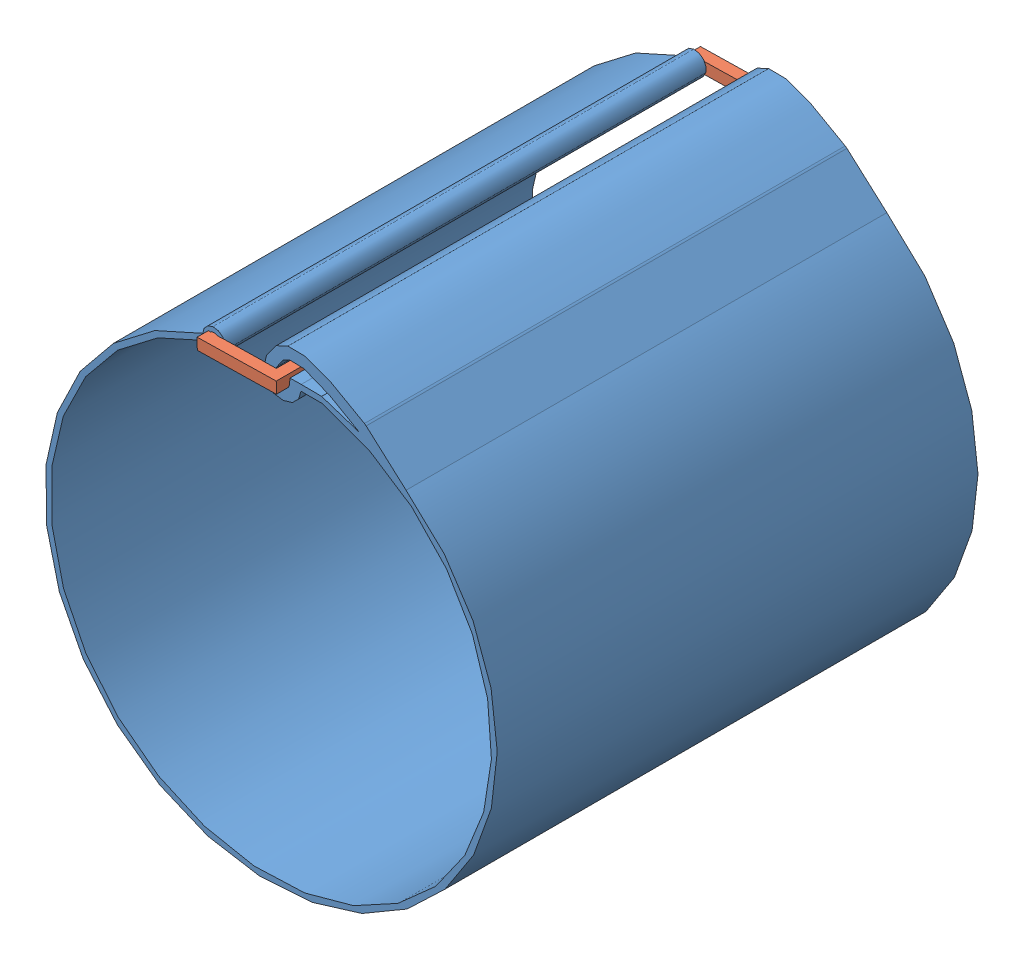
SolidWorks assembly Strap Assembly.SLDASM, configuration Default (file format 3800). Lengths in mm.
Overall size (101.6 106.52 113.03).
2 component instances, 2 part files, 1 mates.
Components (placement in the parent):
- Arm strap-1: Arm strap.SLDPRT [Default] at (16.1544 26.4731 -26.5099) size (101.6 106.52 107.95)
- Buckle-2: Buckle.SLDPRT [Default] at (4.6539 73.5472 81.4145) x (0.999808 0.019608 0) z (-0.019608 0.999808 0) size (17.78 113.03 2.54)
Mates (geometry in assembly coordinates):
- Concentric3: concentric anti-aligned: cylinder of Arm strap-1; line of Buckle-2
